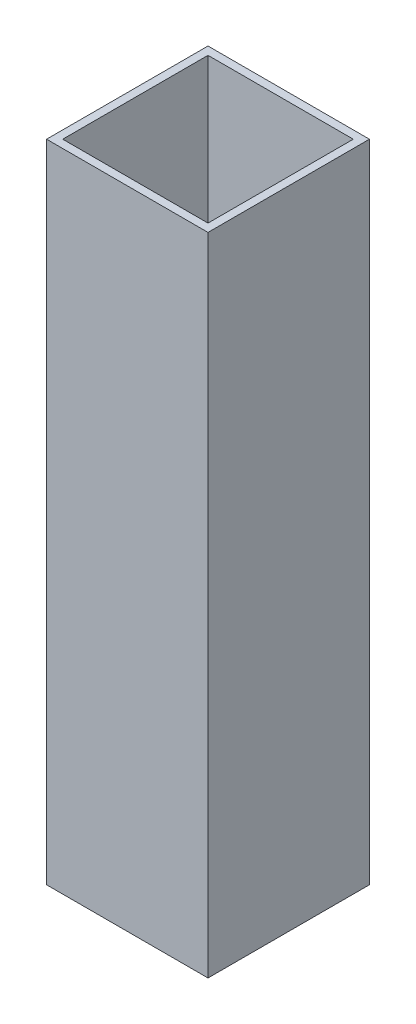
ISO-10303-21;
HEADER;
FILE_DESCRIPTION(('STEP AP214'),'2;1');
FILE_NAME('part.step','',(''),(''),'','','');
FILE_SCHEMA(('AUTOMOTIVE_DESIGN { 1 0 10303 214 1 1 1 1 }'));
ENDSEC;
DATA;
#1=APPLICATION_CONTEXT('core data for automotive mechanical design processes');
#2=APPLICATION_PROTOCOL_DEFINITION('international standard','automotive_design',2000,#1);
#3=PRODUCT_CONTEXT('',#1,'mechanical');
#4=PRODUCT('Part','Part','',(#3));
#5=PRODUCT_RELATED_PRODUCT_CATEGORY('part','',(#4));
#6=PRODUCT_DEFINITION_FORMATION('','',#4);
#7=PRODUCT_DEFINITION_CONTEXT('part definition',#1,'design');
#8=PRODUCT_DEFINITION('design','',#6,#7);
#9=PRODUCT_DEFINITION_SHAPE('','',#8);
#10=(LENGTH_UNIT() NAMED_UNIT(*) SI_UNIT(.MILLI.,.METRE.));
#11=(NAMED_UNIT(*) PLANE_ANGLE_UNIT() SI_UNIT($,.RADIAN.));
#12=(NAMED_UNIT(*) SI_UNIT($,.STERADIAN.) SOLID_ANGLE_UNIT());
#13=UNCERTAINTY_MEASURE_WITH_UNIT(LENGTH_MEASURE(1.E-05),#10,'distance_accuracy_value','');
#14=(GEOMETRIC_REPRESENTATION_CONTEXT(3) GLOBAL_UNCERTAINTY_ASSIGNED_CONTEXT((#13)) GLOBAL_UNIT_ASSIGNED_CONTEXT((#10,
#11,#12)) REPRESENTATION_CONTEXT('',''));
#15=CARTESIAN_POINT('',(0.,0.,0.));
#16=DIRECTION('',(0.,0.,1.));
#17=DIRECTION('',(1.,0.,0.));
#18=AXIS2_PLACEMENT_3D('',#15,#16,#17);
#19=CARTESIAN_POINT('',(25.,200.,-25.));
#20=DIRECTION('',(-1.,0.,0.));
#21=DIRECTION('',(0.,0.,1.));
#22=AXIS2_PLACEMENT_3D('',#19,#20,#21);
#23=PLANE('',#22);
#24=DIRECTION('',(0.,0.,-1.));
#25=VECTOR('',#24,1.);
#26=CARTESIAN_POINT('',(25.,0.,-25.));
#27=LINE('',#26,#25);
#28=CARTESIAN_POINT('',(25.,0.,25.));
#29=VERTEX_POINT('',#28);
#30=CARTESIAN_POINT('',(25.,0.,-25.));
#31=VERTEX_POINT('',#30);
#32=EDGE_CURVE('E161',#29,#31,#27,.T.);
#33=ORIENTED_EDGE('',*,*,#32,.T.);
#34=DIRECTION('',(0.,-1.,0.));
#35=VECTOR('',#34,1.);
#36=CARTESIAN_POINT('',(25.,200.,-25.));
#37=LINE('',#36,#35);
#38=CARTESIAN_POINT('',(25.,200.,-25.));
#39=VERTEX_POINT('',#38);
#40=EDGE_CURVE('E11',#39,#31,#37,.T.);
#41=ORIENTED_EDGE('',*,*,#40,.F.);
#42=DIRECTION('',(0.,0.,-1.));
#43=VECTOR('',#42,1.);
#44=CARTESIAN_POINT('',(25.,200.,-25.));
#45=LINE('',#44,#43);
#46=CARTESIAN_POINT('',(25.,200.,25.));
#47=VERTEX_POINT('',#46);
#48=EDGE_CURVE('E146',#47,#39,#45,.T.);
#49=ORIENTED_EDGE('',*,*,#48,.F.);
#50=DIRECTION('',(0.,-1.,0.));
#51=VECTOR('',#50,1.);
#52=CARTESIAN_POINT('',(25.,200.,25.));
#53=LINE('',#52,#51);
#54=EDGE_CURVE('E160',#47,#29,#53,.T.);
#55=ORIENTED_EDGE('',*,*,#54,.T.);
#56=EDGE_LOOP('',(#33,#41,#49,#55));
#57=FACE_BOUND('',#56,.T.);
#58=ADVANCED_FACE('F39',(#57),#23,.F.);
#59=CARTESIAN_POINT('',(-25.,200.,-25.));
#60=DIRECTION('',(0.,0.,1.));
#61=DIRECTION('',(1.,0.,0.));
#62=AXIS2_PLACEMENT_3D('',#59,#60,#61);
#63=PLANE('',#62);
#64=DIRECTION('',(-1.,0.,0.));
#65=VECTOR('',#64,1.);
#66=CARTESIAN_POINT('',(-25.,0.,-25.));
#67=LINE('',#66,#65);
#68=CARTESIAN_POINT('',(-25.,0.,-25.));
#69=VERTEX_POINT('',#68);
#70=EDGE_CURVE('E165',#31,#69,#67,.T.);
#71=ORIENTED_EDGE('',*,*,#70,.T.);
#72=DIRECTION('',(0.,-1.,0.));
#73=VECTOR('',#72,1.);
#74=CARTESIAN_POINT('',(-25.,200.,-25.));
#75=LINE('',#74,#73);
#76=CARTESIAN_POINT('',(-25.,200.,-25.));
#77=VERTEX_POINT('',#76);
#78=EDGE_CURVE('E47',#77,#69,#75,.T.);
#79=ORIENTED_EDGE('',*,*,#78,.F.);
#80=DIRECTION('',(-1.,0.,0.));
#81=VECTOR('',#80,1.);
#82=CARTESIAN_POINT('',(-25.,200.,-25.));
#83=LINE('',#82,#81);
#84=EDGE_CURVE('E150',#39,#77,#83,.T.);
#85=ORIENTED_EDGE('',*,*,#84,.F.);
#86=ORIENTED_EDGE('',*,*,#40,.T.);
#87=EDGE_LOOP('',(#71,#79,#85,#86));
#88=FACE_BOUND('',#87,.T.);
#89=ADVANCED_FACE('F199',(#88),#63,.F.);
#90=CARTESIAN_POINT('',(-25.,200.,-25.));
#91=DIRECTION('',(1.,0.,0.));
#92=DIRECTION('',(0.,0.,-1.));
#93=AXIS2_PLACEMENT_3D('',#90,#91,#92);
#94=PLANE('',#93);
#95=DIRECTION('',(0.,0.,1.));
#96=VECTOR('',#95,1.);
#97=CARTESIAN_POINT('',(-25.,0.,-25.));
#98=LINE('',#97,#96);
#99=CARTESIAN_POINT('',(-25.,0.,25.));
#100=VERTEX_POINT('',#99);
#101=EDGE_CURVE('E168',#69,#100,#98,.T.);
#102=ORIENTED_EDGE('',*,*,#101,.T.);
#103=DIRECTION('',(0.,-1.,0.));
#104=VECTOR('',#103,1.);
#105=CARTESIAN_POINT('',(-25.,200.,25.));
#106=LINE('',#105,#104);
#107=CARTESIAN_POINT('',(-25.,200.,25.));
#108=VERTEX_POINT('',#107);
#109=EDGE_CURVE('E176',#108,#100,#106,.T.);
#110=ORIENTED_EDGE('',*,*,#109,.F.);
#111=DIRECTION('',(0.,0.,1.));
#112=VECTOR('',#111,1.);
#113=CARTESIAN_POINT('',(-25.,200.,-25.));
#114=LINE('',#113,#112);
#115=EDGE_CURVE('E154',#77,#108,#114,.T.);
#116=ORIENTED_EDGE('',*,*,#115,.F.);
#117=ORIENTED_EDGE('',*,*,#78,.T.);
#118=EDGE_LOOP('',(#102,#110,#116,#117));
#119=FACE_BOUND('',#118,.T.);
#120=ADVANCED_FACE('F185',(#119),#94,.F.);
#121=CARTESIAN_POINT('',(-25.,200.,25.));
#122=DIRECTION('',(0.,0.,-1.));
#123=DIRECTION('',(-1.,0.,0.));
#124=AXIS2_PLACEMENT_3D('',#121,#122,#123);
#125=PLANE('',#124);
#126=DIRECTION('',(1.,0.,0.));
#127=VECTOR('',#126,1.);
#128=CARTESIAN_POINT('',(-25.,0.,25.));
#129=LINE('',#128,#127);
#130=EDGE_CURVE('E151',#100,#29,#129,.T.);
#131=ORIENTED_EDGE('',*,*,#130,.T.);
#132=ORIENTED_EDGE('',*,*,#54,.F.);
#133=DIRECTION('',(1.,0.,0.));
#134=VECTOR('',#133,1.);
#135=CARTESIAN_POINT('',(-25.,200.,25.));
#136=LINE('',#135,#134);
#137=EDGE_CURVE('E157',#108,#47,#136,.T.);
#138=ORIENTED_EDGE('',*,*,#137,.F.);
#139=ORIENTED_EDGE('',*,*,#109,.T.);
#140=EDGE_LOOP('',(#131,#132,#138,#139));
#141=FACE_BOUND('',#140,.T.);
#142=ADVANCED_FACE('F192',(#141),#125,.F.);
#143=CARTESIAN_POINT('',(0.,200.,0.));
#144=DIRECTION('',(0.,1.,0.));
#145=DIRECTION('',(0.,0.,1.));
#146=AXIS2_PLACEMENT_3D('',#143,#144,#145);
#147=PLANE('',#146);
#148=DIRECTION('',(0.,0.,-1.));
#149=VECTOR('',#148,1.);
#150=CARTESIAN_POINT('',(22.5,200.,-25.));
#151=LINE('',#150,#149);
#152=CARTESIAN_POINT('',(22.5,200.,22.5));
#153=VERTEX_POINT('',#152);
#154=CARTESIAN_POINT('',(22.5,200.,-22.5));
#155=VERTEX_POINT('',#154);
#156=EDGE_CURVE('E128',#153,#155,#151,.T.);
#157=ORIENTED_EDGE('',*,*,#156,.F.);
#158=DIRECTION('',(1.,0.,0.));
#159=VECTOR('',#158,1.);
#160=CARTESIAN_POINT('',(-25.,200.,22.5));
#161=LINE('',#160,#159);
#162=CARTESIAN_POINT('',(-22.5,200.,22.5));
#163=VERTEX_POINT('',#162);
#164=EDGE_CURVE('E109',#163,#153,#161,.T.);
#165=ORIENTED_EDGE('',*,*,#164,.F.);
#166=DIRECTION('',(0.,0.,1.));
#167=VECTOR('',#166,1.);
#168=CARTESIAN_POINT('',(-22.5,200.,-25.));
#169=LINE('',#168,#167);
#170=CARTESIAN_POINT('',(-22.5,200.,-22.5));
#171=VERTEX_POINT('',#170);
#172=EDGE_CURVE('E141',#171,#163,#169,.T.);
#173=ORIENTED_EDGE('',*,*,#172,.F.);
#174=DIRECTION('',(-1.,0.,0.));
#175=VECTOR('',#174,1.);
#176=CARTESIAN_POINT('',(-25.,200.,-22.5));
#177=LINE('',#176,#175);
#178=EDGE_CURVE('E132',#155,#171,#177,.T.);
#179=ORIENTED_EDGE('',*,*,#178,.F.);
#180=EDGE_LOOP('',(#157,#165,#173,#179));
#181=FACE_BOUND('',#180,.T.);
#182=ORIENTED_EDGE('',*,*,#48,.T.);
#183=ORIENTED_EDGE('',*,*,#84,.T.);
#184=ORIENTED_EDGE('',*,*,#115,.T.);
#185=ORIENTED_EDGE('',*,*,#137,.T.);
#186=EDGE_LOOP('',(#182,#183,#184,#185));
#187=FACE_BOUND('',#186,.T.);
#188=ADVANCED_FACE('F198',(#181,#187),#147,.T.);
#189=CARTESIAN_POINT('',(0.,0.,0.));
#190=DIRECTION('',(0.,1.,0.));
#191=DIRECTION('',(0.,0.,1.));
#192=AXIS2_PLACEMENT_3D('',#189,#190,#191);
#193=PLANE('',#192);
#194=DIRECTION('',(1.,0.,0.));
#195=VECTOR('',#194,1.);
#196=CARTESIAN_POINT('',(-25.,0.,22.5));
#197=LINE('',#196,#195);
#198=CARTESIAN_POINT('',(-22.5,0.,22.5));
#199=VERTEX_POINT('',#198);
#200=CARTESIAN_POINT('',(22.5,0.,22.5));
#201=VERTEX_POINT('',#200);
#202=EDGE_CURVE('E107',#199,#201,#197,.T.);
#203=ORIENTED_EDGE('',*,*,#202,.T.);
#204=DIRECTION('',(0.,0.,-1.));
#205=VECTOR('',#204,1.);
#206=CARTESIAN_POINT('',(22.5,0.,-25.));
#207=LINE('',#206,#205);
#208=CARTESIAN_POINT('',(22.5,0.,-22.5));
#209=VERTEX_POINT('',#208);
#210=EDGE_CURVE('E116',#201,#209,#207,.T.);
#211=ORIENTED_EDGE('',*,*,#210,.T.);
#212=DIRECTION('',(-1.,0.,0.));
#213=VECTOR('',#212,1.);
#214=CARTESIAN_POINT('',(-25.,0.,-22.5));
#215=LINE('',#214,#213);
#216=CARTESIAN_POINT('',(-22.5,0.,-22.5));
#217=VERTEX_POINT('',#216);
#218=EDGE_CURVE('E123',#209,#217,#215,.T.);
#219=ORIENTED_EDGE('',*,*,#218,.T.);
#220=DIRECTION('',(0.,0.,1.));
#221=VECTOR('',#220,1.);
#222=CARTESIAN_POINT('',(-22.5,0.,-25.));
#223=LINE('',#222,#221);
#224=EDGE_CURVE('E61',#217,#199,#223,.T.);
#225=ORIENTED_EDGE('',*,*,#224,.T.);
#226=EDGE_LOOP('',(#203,#211,#219,#225));
#227=FACE_BOUND('',#226,.T.);
#228=ORIENTED_EDGE('',*,*,#32,.F.);
#229=ORIENTED_EDGE('',*,*,#130,.F.);
#230=ORIENTED_EDGE('',*,*,#101,.F.);
#231=ORIENTED_EDGE('',*,*,#70,.F.);
#232=EDGE_LOOP('',(#228,#229,#230,#231));
#233=FACE_BOUND('',#232,.T.);
#234=ADVANCED_FACE('F125',(#227,#233),#193,.F.);
#235=CARTESIAN_POINT('',(22.5,200.,-25.));
#236=DIRECTION('',(-1.,0.,0.));
#237=DIRECTION('',(0.,0.,1.));
#238=AXIS2_PLACEMENT_3D('',#235,#236,#237);
#239=PLANE('',#238);
#240=ORIENTED_EDGE('',*,*,#210,.F.);
#241=DIRECTION('',(0.,-1.,0.));
#242=VECTOR('',#241,1.);
#243=CARTESIAN_POINT('',(22.5,200.,22.5));
#244=LINE('',#243,#242);
#245=EDGE_CURVE('E103',#153,#201,#244,.T.);
#246=ORIENTED_EDGE('',*,*,#245,.F.);
#247=ORIENTED_EDGE('',*,*,#156,.T.);
#248=DIRECTION('',(0.,-1.,0.));
#249=VECTOR('',#248,1.);
#250=CARTESIAN_POINT('',(22.5,200.,-22.5));
#251=LINE('',#250,#249);
#252=EDGE_CURVE('E119',#155,#209,#251,.T.);
#253=ORIENTED_EDGE('',*,*,#252,.T.);
#254=EDGE_LOOP('',(#240,#246,#247,#253));
#255=FACE_BOUND('',#254,.T.);
#256=ADVANCED_FACE('F117',(#255),#239,.T.);
#257=CARTESIAN_POINT('',(-25.,200.,-22.5));
#258=DIRECTION('',(0.,0.,1.));
#259=DIRECTION('',(1.,0.,0.));
#260=AXIS2_PLACEMENT_3D('',#257,#258,#259);
#261=PLANE('',#260);
#262=ORIENTED_EDGE('',*,*,#218,.F.);
#263=ORIENTED_EDGE('',*,*,#252,.F.);
#264=ORIENTED_EDGE('',*,*,#178,.T.);
#265=DIRECTION('',(0.,-1.,0.));
#266=VECTOR('',#265,1.);
#267=CARTESIAN_POINT('',(-22.5,200.,-22.5));
#268=LINE('',#267,#266);
#269=EDGE_CURVE('E283',#171,#217,#268,.T.);
#270=ORIENTED_EDGE('',*,*,#269,.T.);
#271=EDGE_LOOP('',(#262,#263,#264,#270));
#272=FACE_BOUND('',#271,.T.);
#273=ADVANCED_FACE('F219',(#272),#261,.T.);
#274=CARTESIAN_POINT('',(-22.5,200.,-25.));
#275=DIRECTION('',(1.,0.,0.));
#276=DIRECTION('',(0.,0.,-1.));
#277=AXIS2_PLACEMENT_3D('',#274,#275,#276);
#278=PLANE('',#277);
#279=ORIENTED_EDGE('',*,*,#224,.F.);
#280=ORIENTED_EDGE('',*,*,#269,.F.);
#281=ORIENTED_EDGE('',*,*,#172,.T.);
#282=DIRECTION('',(0.,-1.,0.));
#283=VECTOR('',#282,1.);
#284=CARTESIAN_POINT('',(-22.5,200.,22.5));
#285=LINE('',#284,#283);
#286=EDGE_CURVE('E54',#163,#199,#285,.T.);
#287=ORIENTED_EDGE('',*,*,#286,.T.);
#288=EDGE_LOOP('',(#279,#280,#281,#287));
#289=FACE_BOUND('',#288,.T.);
#290=ADVANCED_FACE('F216',(#289),#278,.T.);
#291=CARTESIAN_POINT('',(-25.,200.,22.5));
#292=DIRECTION('',(0.,0.,-1.));
#293=DIRECTION('',(-1.,0.,0.));
#294=AXIS2_PLACEMENT_3D('',#291,#292,#293);
#295=PLANE('',#294);
#296=ORIENTED_EDGE('',*,*,#202,.F.);
#297=ORIENTED_EDGE('',*,*,#286,.F.);
#298=ORIENTED_EDGE('',*,*,#164,.T.);
#299=ORIENTED_EDGE('',*,*,#245,.T.);
#300=EDGE_LOOP('',(#296,#297,#298,#299));
#301=FACE_BOUND('',#300,.T.);
#302=ADVANCED_FACE('F105',(#301),#295,.T.);
#303=CLOSED_SHELL('',(#58,#89,#120,#142,#188,#234,#256,#273,#290,#302));
#304=MANIFOLD_SOLID_BREP('B2',#303);
#305=ADVANCED_BREP_SHAPE_REPRESENTATION('',(#18,#304),#14);
#306=SHAPE_DEFINITION_REPRESENTATION(#9,#305);
ENDSEC;
END-ISO-10303-21;
